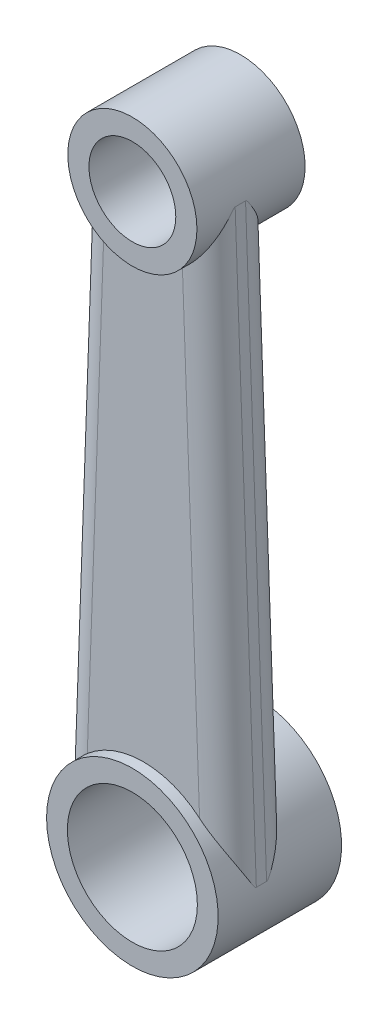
ISO-10303-21;
HEADER;
FILE_DESCRIPTION(('STEP AP214'),'2;1');
FILE_NAME('part.step','',(''),(''),'','','');
FILE_SCHEMA(('AUTOMOTIVE_DESIGN { 1 0 10303 214 1 1 1 1 }'));
ENDSEC;
DATA;
#1=APPLICATION_CONTEXT('core data for automotive mechanical design processes');
#2=APPLICATION_PROTOCOL_DEFINITION('international standard','automotive_design',2000,#1);
#3=PRODUCT_CONTEXT('',#1,'mechanical');
#4=PRODUCT('Part','Part','',(#3));
#5=PRODUCT_RELATED_PRODUCT_CATEGORY('part','',(#4));
#6=PRODUCT_DEFINITION_FORMATION('','',#4);
#7=PRODUCT_DEFINITION_CONTEXT('part definition',#1,'design');
#8=PRODUCT_DEFINITION('design','',#6,#7);
#9=PRODUCT_DEFINITION_SHAPE('','',#8);
#10=(LENGTH_UNIT() NAMED_UNIT(*) SI_UNIT(.MILLI.,.METRE.));
#11=(NAMED_UNIT(*) PLANE_ANGLE_UNIT() SI_UNIT($,.RADIAN.));
#12=(NAMED_UNIT(*) SI_UNIT($,.STERADIAN.) SOLID_ANGLE_UNIT());
#13=UNCERTAINTY_MEASURE_WITH_UNIT(LENGTH_MEASURE(1.E-05),#10,'distance_accuracy_value','');
#14=(GEOMETRIC_REPRESENTATION_CONTEXT(3) GLOBAL_UNCERTAINTY_ASSIGNED_CONTEXT((#13)) GLOBAL_UNIT_ASSIGNED_CONTEXT((#10,
#11,#12)) REPRESENTATION_CONTEXT('',''));
#15=CARTESIAN_POINT('',(0.,0.,0.));
#16=DIRECTION('',(0.,0.,1.));
#17=DIRECTION('',(1.,0.,0.));
#18=AXIS2_PLACEMENT_3D('',#15,#16,#17);
#19=CARTESIAN_POINT('',(0.,57.15,-6.31613333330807));
#20=DIRECTION('',(0.,0.,1.));
#21=DIRECTION('',(1.,0.,0.));
#22=AXIS2_PLACEMENT_3D('',#19,#20,#21);
#23=CYLINDRICAL_SURFACE('',#22,4.24179999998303);
#24=CARTESIAN_POINT('',(0.,57.15,-6.31613333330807));
#25=DIRECTION('',(0.,0.,1.));
#26=DIRECTION('',(1.,0.,0.));
#27=AXIS2_PLACEMENT_3D('',#24,#25,#26);
#28=CIRCLE('',#27,4.24179999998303);
#29=CARTESIAN_POINT('',(4.24179999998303,57.15,-6.31613333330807));
#30=VERTEX_POINT('',#29);
#31=EDGE_CURVE('E172',#30,#30,#28,.T.);
#32=ORIENTED_EDGE('',*,*,#31,.F.);
#33=EDGE_LOOP('',(#32));
#34=FACE_BOUND('',#33,.T.);
#35=CARTESIAN_POINT('',(0.,57.15,4.25026666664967));
#36=DIRECTION('',(0.,0.,1.));
#37=DIRECTION('',(1.,0.,0.));
#38=AXIS2_PLACEMENT_3D('',#35,#36,#37);
#39=CIRCLE('',#38,4.24179999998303);
#40=CARTESIAN_POINT('',(4.24179999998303,57.15,4.25026666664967));
#41=VERTEX_POINT('',#40);
#42=EDGE_CURVE('E20',#41,#41,#39,.F.);
#43=ORIENTED_EDGE('',*,*,#42,.F.);
#44=EDGE_LOOP('',(#43));
#45=FACE_BOUND('',#44,.T.);
#46=ADVANCED_FACE('F17',(#34,#45),#23,.F.);
#47=CARTESIAN_POINT('',(0.,0.,-7.80635133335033));
#48=DIRECTION('',(0.,0.,1.));
#49=DIRECTION('',(1.,0.,0.));
#50=AXIS2_PLACEMENT_3D('',#47,#48,#49);
#51=CYLINDRICAL_SURFACE('',#50,6.3499999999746);
#52=CARTESIAN_POINT('',(0.,0.,-7.80635133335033));
#53=DIRECTION('',(0.,0.,1.));
#54=DIRECTION('',(1.,0.,0.));
#55=AXIS2_PLACEMENT_3D('',#52,#53,#54);
#56=CIRCLE('',#55,6.3499999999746);
#57=CARTESIAN_POINT('',(6.3499999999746,0.,-7.80635133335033));
#58=VERTEX_POINT('',#57);
#59=EDGE_CURVE('E169',#58,#58,#56,.T.);
#60=ORIENTED_EDGE('',*,*,#59,.F.);
#61=EDGE_LOOP('',(#60));
#62=FACE_BOUND('',#61,.T.);
#63=CARTESIAN_POINT('',(0.,0.,4.25026666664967));
#64=DIRECTION('',(0.,0.,1.));
#65=DIRECTION('',(1.,0.,0.));
#66=AXIS2_PLACEMENT_3D('',#63,#64,#65);
#67=CIRCLE('',#66,6.3499999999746);
#68=CARTESIAN_POINT('',(6.3499999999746,0.,4.25026666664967));
#69=VERTEX_POINT('',#68);
#70=EDGE_CURVE('E120',#69,#69,#67,.F.);
#71=ORIENTED_EDGE('',*,*,#70,.F.);
#72=EDGE_LOOP('',(#71));
#73=FACE_BOUND('',#72,.T.);
#74=ADVANCED_FACE('F236',(#62,#73),#51,.F.);
#75=CARTESIAN_POINT('',(-7.34483333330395,28.575,0.0042333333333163));
#76=DIRECTION('',(-0.999341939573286,0.0362724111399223,0.));
#77=DIRECTION('',(-0.0362724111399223,-0.999341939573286,0.));
#78=AXIS2_PLACEMENT_3D('',#75,#76,#77);
#79=PLANE('',#78);
#80=DIRECTION('',(-0.0362724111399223,-0.999341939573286,0.));
#81=VECTOR('',#80,1.);
#82=CARTESIAN_POINT('',(-8.35994380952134,0.607670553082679,-0.499866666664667));
#83=LINE('',#82,#81);
#84=CARTESIAN_POINT('',(-8.35994380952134,0.607670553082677,-0.499866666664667));
#85=VERTEX_POINT('',#84);
#86=CARTESIAN_POINT('',(-6.30766666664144,57.15,-0.499866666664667));
#87=VERTEX_POINT('',#86);
#88=EDGE_CURVE('E99',#85,#87,#83,.F.);
#89=ORIENTED_EDGE('',*,*,#88,.F.);
#90=DIRECTION('',(0.,0.,1.));
#91=VECTOR('',#90,1.);
#92=CARTESIAN_POINT('',(-8.35994380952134,0.607670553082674,0.0042333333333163));
#93=LINE('',#92,#91);
#94=CARTESIAN_POINT('',(-8.35994380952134,0.607670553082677,0.500017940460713));
#95=VERTEX_POINT('',#94);
#96=EDGE_CURVE('E173',#85,#95,#93,.T.);
#97=ORIENTED_EDGE('',*,*,#96,.T.);
#98=DIRECTION('',(-0.0362724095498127,-0.999341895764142,-0.000296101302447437));
#99=VECTOR('',#98,1.);
#100=CARTESIAN_POINT('',(-8.35994380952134,0.607670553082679,0.500017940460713));
#101=LINE('',#100,#99);
#102=CARTESIAN_POINT('',(-6.30766666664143,57.15,0.516771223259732));
#103=VERTEX_POINT('',#102);
#104=EDGE_CURVE('E100',#103,#95,#101,.T.);
#105=ORIENTED_EDGE('',*,*,#104,.F.);
#106=DIRECTION('',(0.,0.,1.));
#107=VECTOR('',#106,1.);
#108=CARTESIAN_POINT('',(-6.30766666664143,57.15,0.0042333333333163));
#109=LINE('',#108,#107);
#110=EDGE_CURVE('E72',#103,#87,#109,.F.);
#111=ORIENTED_EDGE('',*,*,#110,.T.);
#112=EDGE_LOOP('',(#89,#97,#105,#111));
#113=FACE_BOUND('',#112,.T.);
#114=ADVANCED_FACE('F232',(#113),#79,.T.);
#115=CARTESIAN_POINT('',(0.,0.,4.25026666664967));
#116=DIRECTION('',(0.,0.,1.));
#117=DIRECTION('',(1.,0.,0.));
#118=AXIS2_PLACEMENT_3D('',#115,#116,#117);
#119=PLANE('',#118);
#120=ORIENTED_EDGE('',*,*,#42,.T.);
#121=EDGE_LOOP('',(#120));
#122=FACE_BOUND('',#121,.T.);
#123=CARTESIAN_POINT('',(0.,57.15,4.25026666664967));
#124=DIRECTION('',(0.,0.,1.));
#125=DIRECTION('',(1.,0.,0.));
#126=AXIS2_PLACEMENT_3D('',#123,#124,#125);
#127=CIRCLE('',#126,6.30766666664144);
#128=CARTESIAN_POINT('',(6.30766666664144,57.15,4.25026666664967));
#129=VERTEX_POINT('',#128);
#130=EDGE_CURVE('E89',#129,#129,#127,.F.);
#131=ORIENTED_EDGE('',*,*,#130,.F.);
#132=EDGE_LOOP('',(#131));
#133=FACE_BOUND('',#132,.T.);
#134=ADVANCED_FACE('F235',(#122,#133),#119,.T.);
#135=CARTESIAN_POINT('',(0.,0.,-6.31613333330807));
#136=DIRECTION('',(0.,0.,-1.));
#137=DIRECTION('',(-1.,0.,0.));
#138=AXIS2_PLACEMENT_3D('',#135,#136,#137);
#139=PLANE('',#138);
#140=ORIENTED_EDGE('',*,*,#31,.T.);
#141=EDGE_LOOP('',(#140));
#142=FACE_BOUND('',#141,.T.);
#143=CARTESIAN_POINT('',(0.,57.15,-6.31613333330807));
#144=DIRECTION('',(0.,0.,1.));
#145=DIRECTION('',(1.,0.,0.));
#146=AXIS2_PLACEMENT_3D('',#143,#144,#145);
#147=CIRCLE('',#146,6.30766666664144);
#148=CARTESIAN_POINT('',(6.30766666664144,57.15,-6.31613333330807));
#149=VERTEX_POINT('',#148);
#150=EDGE_CURVE('E149',#149,#149,#147,.T.);
#151=ORIENTED_EDGE('',*,*,#150,.F.);
#152=EDGE_LOOP('',(#151));
#153=FACE_BOUND('',#152,.T.);
#154=ADVANCED_FACE('F243',(#142,#153),#139,.T.);
#155=CARTESIAN_POINT('',(7.34483333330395,28.575,0.00423333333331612));
#156=DIRECTION('',(0.999341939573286,0.0362724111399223,0.));
#157=DIRECTION('',(-0.0362724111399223,0.999341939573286,0.));
#158=AXIS2_PLACEMENT_3D('',#155,#156,#157);
#159=PLANE('',#158);
#160=DIRECTION('',(0.0362724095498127,-0.999341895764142,-0.00029610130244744));
#161=VECTOR('',#160,1.);
#162=CARTESIAN_POINT('',(8.35994380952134,0.607670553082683,0.500017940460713));
#163=LINE('',#162,#161);
#164=CARTESIAN_POINT('',(8.35994380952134,0.607670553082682,0.500017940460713));
#165=VERTEX_POINT('',#164);
#166=CARTESIAN_POINT('',(6.30766666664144,57.15,0.516771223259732));
#167=VERTEX_POINT('',#166);
#168=EDGE_CURVE('E167',#165,#167,#163,.F.);
#169=ORIENTED_EDGE('',*,*,#168,.F.);
#170=DIRECTION('',(0.,0.,1.));
#171=VECTOR('',#170,1.);
#172=CARTESIAN_POINT('',(8.35994380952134,0.607670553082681,0.00423333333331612));
#173=LINE('',#172,#171);
#174=CARTESIAN_POINT('',(8.35994380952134,0.607670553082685,-0.499866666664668));
#175=VERTEX_POINT('',#174);
#176=EDGE_CURVE('E170',#165,#175,#173,.F.);
#177=ORIENTED_EDGE('',*,*,#176,.T.);
#178=DIRECTION('',(0.0362724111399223,-0.999341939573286,0.));
#179=VECTOR('',#178,1.);
#180=CARTESIAN_POINT('',(8.35994380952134,0.607670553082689,-0.499866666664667));
#181=LINE('',#180,#179);
#182=CARTESIAN_POINT('',(6.30766666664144,57.15,-0.499866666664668));
#183=VERTEX_POINT('',#182);
#184=EDGE_CURVE('E148',#183,#175,#181,.T.);
#185=ORIENTED_EDGE('',*,*,#184,.F.);
#186=DIRECTION('',(0.,0.,1.));
#187=VECTOR('',#186,1.);
#188=CARTESIAN_POINT('',(6.30766666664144,57.15,0.));
#189=LINE('',#188,#187);
#190=EDGE_CURVE('E156',#167,#183,#189,.F.);
#191=ORIENTED_EDGE('',*,*,#190,.F.);
#192=EDGE_LOOP('',(#169,#177,#185,#191));
#193=FACE_BOUND('',#192,.T.);
#194=ADVANCED_FACE('F221',(#193),#159,.T.);
#195=CARTESIAN_POINT('',(5.6950319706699,0.51094412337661,0.500017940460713));
#196=DIRECTION('',(0.0362724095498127,-0.999341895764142,-0.00029610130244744));
#197=DIRECTION('',(0.999341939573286,0.0362724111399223,0.));
#198=AXIS2_PLACEMENT_3D('',#195,#196,#197);
#199=CYLINDRICAL_SURFACE('',#198,2.666666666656);
#200=CARTESIAN_POINT('',(8.35994380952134,0.607670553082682,0.500017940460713));
#201=CARTESIAN_POINT('',(8.35994534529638,0.607646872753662,0.506234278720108));
#202=CARTESIAN_POINT('',(8.35990044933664,0.608267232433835,0.512414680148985));
#203=CARTESIAN_POINT('',(8.35973329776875,0.61056144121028,0.524457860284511));
#204=CARTESIAN_POINT('',(8.35961254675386,0.612214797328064,0.530324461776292));
#205=CARTESIAN_POINT('',(8.35924016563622,0.617281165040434,0.544294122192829));
#206=CARTESIAN_POINT('',(8.35895416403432,0.621150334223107,0.552225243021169));
#207=CARTESIAN_POINT('',(8.35828884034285,0.630042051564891,0.567478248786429));
#208=CARTESIAN_POINT('',(8.35790861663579,0.635075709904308,0.57479327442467));
#209=CARTESIAN_POINT('',(8.35592628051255,0.660926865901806,0.608913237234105));
#210=CARTESIAN_POINT('',(8.35391417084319,0.686060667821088,0.632223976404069));
#211=CARTESIAN_POINT('',(8.34945523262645,0.738420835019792,0.676225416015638));
#212=CARTESIAN_POINT('',(8.34700430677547,0.765665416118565,0.696887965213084));
#213=CARTESIAN_POINT('',(8.33920249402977,0.847673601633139,0.756104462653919));
#214=CARTESIAN_POINT('',(8.33332376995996,0.903783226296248,0.792823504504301));
#215=CARTESIAN_POINT('',(8.32028703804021,1.01687895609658,0.864644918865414));
#216=CARTESIAN_POINT('',(8.31312702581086,1.07386630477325,0.899744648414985));
#217=CARTESIAN_POINT('',(8.29759169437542,1.18792941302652,0.968796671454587));
#218=CARTESIAN_POINT('',(8.28922381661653,1.24500265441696,1.00275452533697));
#219=CARTESIAN_POINT('',(8.27125677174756,1.35925898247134,1.070064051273));
#220=CARTESIAN_POINT('',(8.26165828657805,1.41644199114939,1.10341604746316));
#221=CARTESIAN_POINT('',(8.23067884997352,1.58990129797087,1.2038732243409));
#222=CARTESIAN_POINT('',(8.20736305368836,1.70624559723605,1.27028208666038));
#223=CARTESIAN_POINT('',(8.15559574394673,1.93865157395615,1.40158326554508));
#224=CARTESIAN_POINT('',(8.12714349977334,2.05471320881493,1.46647536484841));
#225=CARTESIAN_POINT('',(8.03394408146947,2.40234346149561,1.65888106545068));
#226=CARTESIAN_POINT('',(7.96138283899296,2.63319558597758,1.78403086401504));
#227=CARTESIAN_POINT('',(7.79460905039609,3.09222285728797,2.02632527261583));
#228=CARTESIAN_POINT('',(7.70033272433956,3.32038799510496,2.14344495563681));
#229=CARTESIAN_POINT('',(7.48950251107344,3.77190371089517,2.36611901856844));
#230=CARTESIAN_POINT('',(7.37296847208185,3.9952583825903,2.4716835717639));
#231=CARTESIAN_POINT('',(7.16768815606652,4.34807491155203,2.62831970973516));
#232=CARTESIAN_POINT('',(7.08627203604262,4.47961584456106,2.68438930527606));
#233=CARTESIAN_POINT('',(6.9148815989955,4.7398956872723,2.78966934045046));
#234=CARTESIAN_POINT('',(6.82490671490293,4.86863441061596,2.83887932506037));
#235=CARTESIAN_POINT('',(6.63682145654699,5.12203980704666,2.92881177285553));
#236=CARTESIAN_POINT('',(6.53875460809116,5.24672380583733,2.96957597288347));
#237=CARTESIAN_POINT('',(6.33422664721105,5.49190038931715,3.04125858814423));
#238=CARTESIAN_POINT('',(6.22777029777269,5.61239529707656,3.07218254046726));
#239=CARTESIAN_POINT('',(6.01797715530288,5.83634460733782,3.11971281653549));
#240=CARTESIAN_POINT('',(5.91542434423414,5.94028569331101,3.1374554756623));
#241=CARTESIAN_POINT('',(5.70397927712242,6.14363571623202,3.16179292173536));
#242=CARTESIAN_POINT('',(5.59506575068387,6.24302719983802,3.16834779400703));
#243=CARTESIAN_POINT('',(5.48344694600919,6.33953733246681,3.1684117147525));
#244=B_SPLINE_CURVE_WITH_KNOTS('',3,(#200,#201,#202,#203,#204,#205,#206,#207,#208,#209,#210,
#211,#212,#213,#214,#215,#216,#217,#218,#219,#220,#221,#222,#223,#224,#225,#226,#227,#228,#229,
#230,#231,#232,#233,#234,#235,#236,#237,#238,#239,#240,#241,#242,#243),.UNSPECIFIED.,.F.,.F.,(4,
2,2,2,2,2,2,2,2,2,2,2,2,2,2,2,2,2,2,2,2,4),(0.,0.0185603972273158,0.0367637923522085,
0.0631006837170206,0.0897000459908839,0.191654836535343,0.294616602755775,0.496270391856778,
0.698242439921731,0.899019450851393,1.0996856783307,1.50749050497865,1.91535339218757,
2.73164442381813,3.55036428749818,4.36835744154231,4.86166942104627,5.35501410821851,
5.84585938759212,6.33642797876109,6.7771011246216,7.21934319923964),.UNSPECIFIED.);
#245=CARTESIAN_POINT('',(5.48344694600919,6.33953733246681,3.1684117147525));
#246=VERTEX_POINT('',#245);
#247=EDGE_CURVE('E150',#165,#246,#244,.T.);
#248=ORIENTED_EDGE('',*,*,#247,.F.);
#249=ORIENTED_EDGE('',*,*,#168,.T.);
#250=CARTESIAN_POINT('',(3.82136288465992,52.1316492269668,3.18197974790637));
#251=CARTESIAN_POINT('',(3.91233313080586,52.2008918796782,3.18199280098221));
#252=CARTESIAN_POINT('',(4.00131565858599,52.2725845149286,3.17711515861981));
#253=CARTESIAN_POINT('',(4.17460117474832,52.4200735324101,3.15870059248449));
#254=CARTESIAN_POINT('',(4.25891271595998,52.4958618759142,3.14518010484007));
#255=CARTESIAN_POINT('',(4.42161587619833,52.6501739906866,3.11078078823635));
#256=CARTESIAN_POINT('',(4.50006169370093,52.7286592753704,3.08998318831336));
#257=CARTESIAN_POINT('',(4.65182999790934,52.8886272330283,3.04195729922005));
#258=CARTESIAN_POINT('',(4.7251492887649,52.9701117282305,3.01472504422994));
#259=CARTESIAN_POINT('',(4.89190860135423,53.1653086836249,2.94391434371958));
#260=CARTESIAN_POINT('',(4.98311189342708,53.2800806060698,2.89797838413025));
#261=CARTESIAN_POINT('',(5.15573221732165,53.5132240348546,2.7977105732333));
#262=CARTESIAN_POINT('',(5.23714724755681,53.6315962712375,2.7433770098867));
#263=CARTESIAN_POINT('',(5.39083734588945,53.8718914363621,2.62749513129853));
#264=CARTESIAN_POINT('',(5.46305296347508,53.99383175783,2.56590439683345));
#265=CARTESIAN_POINT('',(5.59801070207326,54.2399086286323,2.43706855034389));
#266=CARTESIAN_POINT('',(5.66075268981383,54.3640452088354,2.36982335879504));
#267=CARTESIAN_POINT('',(5.80073851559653,54.6649015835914,2.20241596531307));
#268=CARTESIAN_POINT('',(5.87349389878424,54.842462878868,2.09999418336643));
#269=CARTESIAN_POINT('',(6.0016298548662,55.1998298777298,1.88833817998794));
#270=CARTESIAN_POINT('',(6.05700107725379,55.3796367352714,1.77910033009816));
#271=CARTESIAN_POINT('',(6.15084786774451,55.7399450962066,1.55591172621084));
#272=CARTESIAN_POINT('',(6.18937390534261,55.9204428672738,1.44197618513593));
#273=CARTESIAN_POINT('',(6.23503025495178,56.1911334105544,1.26802389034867));
#274=CARTESIAN_POINT('',(6.24822553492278,56.2813367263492,1.20954328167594));
#275=CARTESIAN_POINT('',(6.27063160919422,56.4614699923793,1.09141643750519));
#276=CARTESIAN_POINT('',(6.27984265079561,56.5513999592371,1.03177027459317));
#277=CARTESIAN_POINT('',(6.29309522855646,56.7151050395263,0.920984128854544));
#278=CARTESIAN_POINT('',(6.29775061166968,56.7890187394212,0.870129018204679));
#279=CARTESIAN_POINT('',(6.30314441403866,56.9069556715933,0.785072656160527));
#280=CARTESIAN_POINT('',(6.30469892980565,56.9516719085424,0.751879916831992));
#281=CARTESIAN_POINT('',(6.30643117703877,57.0222771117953,0.694921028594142));
#282=CARTESIAN_POINT('',(6.30690608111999,57.0489733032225,0.672250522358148));
#283=CARTESIAN_POINT('',(6.30736072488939,57.0865602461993,0.635288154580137));
#284=CARTESIAN_POINT('',(6.30746910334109,57.098774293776,0.622349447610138));
#285=CARTESIAN_POINT('',(6.30760973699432,57.1210938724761,0.594761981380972));
#286=CARTESIAN_POINT('',(6.30764284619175,57.1312218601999,0.580134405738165));
#287=CARTESIAN_POINT('',(6.30766136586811,57.1413306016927,0.558451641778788));
#288=CARTESIAN_POINT('',(6.30766374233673,57.1436569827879,0.552542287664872));
#289=CARTESIAN_POINT('',(6.30766635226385,57.1473020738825,0.540431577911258));
#290=CARTESIAN_POINT('',(6.30766659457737,57.1486249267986,0.534231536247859));
#291=CARTESIAN_POINT('',(6.30766665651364,57.1497847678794,0.524251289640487));
#292=CARTESIAN_POINT('',(6.3076666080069,57.150007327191,0.520512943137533));
#293=CARTESIAN_POINT('',(6.30766666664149,57.1499999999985,0.516771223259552));
#294=B_SPLINE_CURVE_WITH_KNOTS('',3,(#250,#251,#252,#253,#254,#255,#256,#257,#258,#259,#260,
#261,#262,#263,#264,#265,#266,#267,#268,#269,#270,#271,#272,#273,#274,#275,#276,#277,#278,#279,
#280,#281,#282,#283,#284,#285,#286,#287,#288,#289,#290,#291,#292,#293),.UNSPECIFIED.,.F.,.F.,(4,
2,2,2,2,2,2,2,2,2,2,2,2,2,2,2,2,2,2,2,2,4),(0.,0.34268462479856,0.684719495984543,
1.02305225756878,1.36159408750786,1.82178278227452,2.28206542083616,2.74518607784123,
3.20831324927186,3.85990228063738,4.51184118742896,5.16181322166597,5.48667308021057,
5.8115127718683,6.08093308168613,6.24805333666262,6.35290658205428,6.40626449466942,
6.45901392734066,6.47800037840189,6.49690801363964,6.50812239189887),.UNSPECIFIED.);
#295=CARTESIAN_POINT('',(3.82136288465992,52.1316492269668,3.18197974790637));
#296=VERTEX_POINT('',#295);
#297=EDGE_CURVE('E88',#296,#167,#294,.T.);
#298=ORIENTED_EDGE('',*,*,#297,.F.);
#299=DIRECTION('',(-0.0362724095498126,0.999341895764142,0.000296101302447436));
#300=VECTOR('',#299,1.);
#301=CARTESIAN_POINT('',(5.48344694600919,6.33953733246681,3.1684117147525));
#302=LINE('',#301,#300);
#303=EDGE_CURVE('E85',#246,#296,#302,.T.);
#304=ORIENTED_EDGE('',*,*,#303,.F.);
#305=EDGE_LOOP('',(#248,#249,#298,#304));
#306=FACE_BOUND('',#305,.T.);
#307=ADVANCED_FACE('F218',(#306),#199,.T.);
#308=CARTESIAN_POINT('',(0.,0.,-7.80635133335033));
#309=DIRECTION('',(0.,0.,-1.));
#310=DIRECTION('',(-1.,0.,0.));
#311=AXIS2_PLACEMENT_3D('',#308,#309,#310);
#312=PLANE('',#311);
#313=ORIENTED_EDGE('',*,*,#59,.T.);
#314=EDGE_LOOP('',(#313));
#315=FACE_BOUND('',#314,.T.);
#316=CARTESIAN_POINT('',(0.,0.,-7.80635133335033));
#317=DIRECTION('',(0.,0.,-1.));
#318=DIRECTION('',(-1.,0.,0.));
#319=AXIS2_PLACEMENT_3D('',#316,#317,#318);
#320=CIRCLE('',#319,8.38199999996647);
#321=CARTESIAN_POINT('',(-8.38199999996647,0.,-7.80635133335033));
#322=VERTEX_POINT('',#321);
#323=EDGE_CURVE('E205',#322,#322,#320,.F.);
#324=ORIENTED_EDGE('',*,*,#323,.F.);
#325=EDGE_LOOP('',(#324));
#326=FACE_BOUND('',#325,.T.);
#327=ADVANCED_FACE('F295',(#315,#326),#312,.T.);
#328=CARTESIAN_POINT('',(0.,0.,4.25026666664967));
#329=DIRECTION('',(0.,0.,1.));
#330=DIRECTION('',(1.,0.,0.));
#331=AXIS2_PLACEMENT_3D('',#328,#329,#330);
#332=PLANE('',#331);
#333=ORIENTED_EDGE('',*,*,#70,.T.);
#334=EDGE_LOOP('',(#333));
#335=FACE_BOUND('',#334,.T.);
#336=CARTESIAN_POINT('',(0.,0.,4.25026666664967));
#337=DIRECTION('',(0.,0.,-1.));
#338=DIRECTION('',(-1.,0.,0.));
#339=AXIS2_PLACEMENT_3D('',#336,#337,#338);
#340=CIRCLE('',#339,8.38199999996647);
#341=CARTESIAN_POINT('',(-8.38199999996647,0.,4.25026666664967));
#342=VERTEX_POINT('',#341);
#343=EDGE_CURVE('E207',#342,#342,#340,.T.);
#344=ORIENTED_EDGE('',*,*,#343,.F.);
#345=EDGE_LOOP('',(#344));
#346=FACE_BOUND('',#345,.T.);
#347=ADVANCED_FACE('F288',(#335,#346),#332,.T.);
#348=CARTESIAN_POINT('',(0.,28.575,3.1749999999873));
#349=DIRECTION('',(0.,-0.000296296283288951,0.999999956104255));
#350=DIRECTION('',(0.,-0.999999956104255,-0.000296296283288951));
#351=AXIS2_PLACEMENT_3D('',#348,#349,#350);
#352=PLANE('',#351);
#353=DIRECTION('',(-0.0362724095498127,-0.999341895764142,-0.000296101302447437));
#354=VECTOR('',#353,1.);
#355=CARTESIAN_POINT('',(-5.6950319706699,0.510153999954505,3.16668449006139));
#356=LINE('',#355,#354);
#357=CARTESIAN_POINT('',(-5.48344694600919,6.33953733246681,3.1684117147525));
#358=VERTEX_POINT('',#357);
#359=CARTESIAN_POINT('',(-3.82136288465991,52.1316492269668,3.18197974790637));
#360=VERTEX_POINT('',#359);
#361=EDGE_CURVE('E82',#358,#360,#356,.F.);
#362=ORIENTED_EDGE('',*,*,#361,.F.);
#363=CARTESIAN_POINT('',(0.,0.,3.16653333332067));
#364=DIRECTION('',(0.,-0.000296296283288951,0.999999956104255));
#365=DIRECTION('',(0.,-0.999999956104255,-0.000296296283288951));
#366=AXIS2_PLACEMENT_3D('',#363,#364,#365);
#367=ELLIPSE('',#366,8.38200036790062,8.38199999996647);
#368=EDGE_CURVE('E184',#246,#358,#367,.T.);
#369=ORIENTED_EDGE('',*,*,#368,.F.);
#370=ORIENTED_EDGE('',*,*,#303,.T.);
#371=CARTESIAN_POINT('',(0.,57.15,3.18346666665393));
#372=DIRECTION('',(0.,-0.000296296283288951,0.999999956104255));
#373=DIRECTION('',(0.,0.999999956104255,0.000296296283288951));
#374=AXIS2_PLACEMENT_3D('',#371,#372,#373);
#375=ELLIPSE('',#374,6.30766694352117,6.30766666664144);
#376=EDGE_CURVE('E78',#360,#296,#375,.T.);
#377=ORIENTED_EDGE('',*,*,#376,.F.);
#378=EDGE_LOOP('',(#362,#369,#370,#377));
#379=FACE_BOUND('',#378,.T.);
#380=ADVANCED_FACE('F80',(#379),#352,.T.);
#381=CARTESIAN_POINT('',(-5.6950319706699,0.510944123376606,0.500017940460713));
#382=DIRECTION('',(-0.0362724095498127,-0.999341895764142,-0.000296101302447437));
#383=DIRECTION('',(0.999341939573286,-0.0362724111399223,0.));
#384=AXIS2_PLACEMENT_3D('',#381,#382,#383);
#385=CYLINDRICAL_SURFACE('',#384,2.666666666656);
#386=CARTESIAN_POINT('',(-5.48344694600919,6.33953733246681,3.1684117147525));
#387=CARTESIAN_POINT('',(-5.59060742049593,6.24687954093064,3.16835477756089));
#388=CARTESIAN_POINT('',(-5.69528692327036,6.15155732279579,3.1623082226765));
#389=CARTESIAN_POINT('',(-5.8989417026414,5.95652093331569,3.1397817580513));
#390=CARTESIAN_POINT('',(-5.99792735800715,5.8568153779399,3.12332153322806));
#391=CARTESIAN_POINT('',(-6.18915170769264,5.65434443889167,3.08165625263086));
#392=CARTESIAN_POINT('',(-6.28143481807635,5.55160707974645,3.05651665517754));
#393=CARTESIAN_POINT('',(-6.45988642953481,5.3429066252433,2.99870973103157));
#394=CARTESIAN_POINT('',(-6.54605105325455,5.23694154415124,2.96603768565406));
#395=CARTESIAN_POINT('',(-6.75115662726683,4.97187942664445,2.87740430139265));
#396=CARTESIAN_POINT('',(-6.86647224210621,4.81121462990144,2.81771370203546));
#397=CARTESIAN_POINT('',(-7.08364798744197,4.48533535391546,2.68733651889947));
#398=CARTESIAN_POINT('',(-7.18550337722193,4.32011929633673,2.61664607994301));
#399=CARTESIAN_POINT('',(-7.37631885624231,3.98560340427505,2.46631491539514));
#400=CARTESIAN_POINT('',(-7.4652379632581,3.81629249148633,2.38664710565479));
#401=CARTESIAN_POINT('',(-7.6301315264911,3.47490192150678,2.22039795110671));
#402=CARTESIAN_POINT('',(-7.70611028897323,3.30282320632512,2.13381892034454));
#403=CARTESIAN_POINT('',(-7.83533125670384,2.98176392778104,1.96823344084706));
#404=CARTESIAN_POINT('',(-7.89027345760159,2.83308013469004,1.88996761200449));
#405=CARTESIAN_POINT('',(-7.99111597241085,2.5347095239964,1.73028883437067));
#406=CARTESIAN_POINT('',(-8.03703141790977,2.38502482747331,1.64888143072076));
#407=CARTESIAN_POINT('',(-8.13500178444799,2.03087186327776,1.45367260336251));
#408=CARTESIAN_POINT('',(-8.18335691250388,1.82600079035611,1.33872023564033));
#409=CARTESIAN_POINT('',(-8.25012188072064,1.48727049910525,1.14482387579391));
#410=CARTESIAN_POINT('',(-8.27309746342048,1.35349474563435,1.06726086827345));
#411=CARTESIAN_POINT('',(-8.3051812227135,1.13543837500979,0.937394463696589));
#412=CARTESIAN_POINT('',(-8.31629490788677,1.05083356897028,0.886152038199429));
#413=CARTESIAN_POINT('',(-8.33215800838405,0.914278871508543,0.799528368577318));
#414=CARTESIAN_POINT('',(-8.33774618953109,0.86174045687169,0.765228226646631));
#415=CARTESIAN_POINT('',(-8.34591682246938,0.777603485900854,0.70591296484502));
#416=CARTESIAN_POINT('',(-8.34885561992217,0.745300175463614,0.682022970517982));
#417=CARTESIAN_POINT('',(-8.35281277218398,0.69906466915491,0.643152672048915));
#418=CARTESIAN_POINT('',(-8.35406217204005,0.683946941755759,0.62960818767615));
#419=CARTESIAN_POINT('',(-8.3563458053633,0.655441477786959,0.600747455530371));
#420=CARTESIAN_POINT('',(-8.35738131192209,0.642043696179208,0.585442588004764));
#421=CARTESIAN_POINT('',(-8.35851144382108,0.62707844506,0.562581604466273));
#422=CARTESIAN_POINT('',(-8.35878132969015,0.623465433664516,0.556419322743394));
#423=CARTESIAN_POINT('',(-8.35924985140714,0.617151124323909,0.543668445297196));
#424=CARTESIAN_POINT('',(-8.35944889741,0.61444458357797,0.53708257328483));
#425=CARTESIAN_POINT('',(-8.35971107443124,0.610865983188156,0.525429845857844));
#426=CARTESIAN_POINT('',(-8.35979670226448,0.609691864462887,0.520458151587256));
#427=CARTESIAN_POINT('',(-8.35991382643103,0.608083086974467,0.510336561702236));
#428=CARTESIAN_POINT('',(-8.35994465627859,0.607657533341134,0.505185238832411));
#429=CARTESIAN_POINT('',(-8.35994380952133,0.607670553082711,0.500017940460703));
#430=B_SPLINE_CURVE_WITH_KNOTS('',3,(#386,#387,#388,#389,#390,#391,#392,#393,#394,#395,#396,
#397,#398,#399,#400,#401,#402,#403,#404,#405,#406,#407,#408,#409,#410,#411,#412,#413,#414,#415,
#416,#417,#418,#419,#420,#421,#422,#423,#424,#425,#426,#427,#428,#429),.UNSPECIFIED.,.F.,.F.,(4,
2,2,2,2,2,2,2,2,2,2,2,2,2,2,2,2,2,2,2,2,4),(0.,0.424630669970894,0.848461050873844,
1.26916238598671,1.69012798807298,2.30891636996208,2.92792211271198,3.54884805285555,
4.16956695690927,4.69963643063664,5.22880962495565,5.94768426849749,6.41654244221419,
6.71505708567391,6.90401184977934,7.02466870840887,7.08566210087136,7.14628127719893,
7.16767722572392,7.18894719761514,7.204221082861,7.2196794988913),.UNSPECIFIED.);
#431=EDGE_CURVE('E97',#358,#95,#430,.T.);
#432=ORIENTED_EDGE('',*,*,#431,.F.);
#433=ORIENTED_EDGE('',*,*,#361,.T.);
#434=CARTESIAN_POINT('',(-6.30766666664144,57.15,0.516771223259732));
#435=CARTESIAN_POINT('',(-6.30766641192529,57.150026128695,0.523128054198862));
#436=CARTESIAN_POINT('',(-6.30766668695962,57.1493742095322,0.529443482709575));
#437=CARTESIAN_POINT('',(-6.30766611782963,57.1469785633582,0.541738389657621));
#438=CARTESIAN_POINT('',(-6.30766529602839,57.145257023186,0.54772206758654));
#439=CARTESIAN_POINT('',(-6.30765935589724,57.1399263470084,0.562193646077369));
#440=CARTESIAN_POINT('',(-6.30765234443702,57.1358065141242,0.570486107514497));
#441=CARTESIAN_POINT('',(-6.30762433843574,57.1263865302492,0.586453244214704));
#442=CARTESIAN_POINT('',(-6.30760319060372,57.1210738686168,0.594120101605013));
#443=CARTESIAN_POINT('',(-6.30746244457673,57.0956614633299,0.627616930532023));
#444=CARTESIAN_POINT('',(-6.30722902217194,57.0719964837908,0.650597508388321));
#445=CARTESIAN_POINT('',(-6.30643689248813,57.0228994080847,0.694407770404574));
#446=CARTESIAN_POINT('',(-6.30587649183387,56.9974587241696,0.715225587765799));
#447=CARTESIAN_POINT('',(-6.30369847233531,56.9206412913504,0.775554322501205));
#448=CARTESIAN_POINT('',(-6.30158266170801,56.8680659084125,0.813589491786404));
#449=CARTESIAN_POINT('',(-6.29595518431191,56.762101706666,0.888398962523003));
#450=CARTESIAN_POINT('',(-6.2924418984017,56.7087120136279,0.92517174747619));
#451=CARTESIAN_POINT('',(-6.28401659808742,56.6016785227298,0.997848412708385));
#452=CARTESIAN_POINT('',(-6.27910902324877,56.5480360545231,1.03375466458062));
#453=CARTESIAN_POINT('',(-6.26788065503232,56.4405962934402,1.10505425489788));
#454=CARTESIAN_POINT('',(-6.26156035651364,56.3867990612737,1.14044776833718));
#455=CARTESIAN_POINT('',(-6.2297538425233,56.1433358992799,1.29963461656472));
#456=CARTESIAN_POINT('',(-6.19613350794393,55.9532086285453,1.42123707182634));
#457=CARTESIAN_POINT('',(-6.1106552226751,55.5737810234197,1.65957275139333));
#458=CARTESIAN_POINT('',(-6.05878130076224,55.384481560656,1.77630161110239));
#459=CARTESIAN_POINT('',(-5.93599322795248,55.0075753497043,2.00317160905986));
#460=CARTESIAN_POINT('',(-5.86504564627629,54.8199721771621,2.1133007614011));
#461=CARTESIAN_POINT('',(-5.70333220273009,54.4482022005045,2.32421722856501));
#462=CARTESIAN_POINT('',(-5.61258429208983,54.2640324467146,2.42501288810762));
#463=CARTESIAN_POINT('',(-5.45365613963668,53.9785004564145,2.57350871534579));
#464=CARTESIAN_POINT('',(-5.39245056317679,53.875447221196,2.62546354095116));
#465=CARTESIAN_POINT('',(-5.26311011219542,53.6713563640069,2.72445775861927));
#466=CARTESIAN_POINT('',(-5.19497387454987,53.5703191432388,2.77149618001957));
#467=CARTESIAN_POINT('',(-4.9805892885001,53.2718563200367,2.90347094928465));
#468=CARTESIAN_POINT('',(-4.82369500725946,53.0778588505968,2.97991659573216));
#469=CARTESIAN_POINT('',(-4.59100398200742,52.8235864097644,3.06207439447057));
#470=CARTESIAN_POINT('',(-4.52705657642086,52.7567010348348,3.08185908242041));
#471=CARTESIAN_POINT('',(-4.3956226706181,52.6252033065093,3.11658133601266));
#472=CARTESIAN_POINT('',(-4.32813769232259,52.5605899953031,3.13152096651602));
#473=CARTESIAN_POINT('',(-4.18926817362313,52.4334746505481,3.15606460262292));
#474=CARTESIAN_POINT('',(-4.11785737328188,52.3709929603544,3.16562618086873));
#475=CARTESIAN_POINT('',(-3.97187658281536,52.2489843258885,3.17859463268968));
#476=CARTESIAN_POINT('',(-3.89730283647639,52.1894610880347,3.1819939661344));
#477=CARTESIAN_POINT('',(-3.82136288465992,52.1316492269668,3.18197974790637));
#478=B_SPLINE_CURVE_WITH_KNOTS('',3,(#434,#435,#436,#437,#438,#439,#440,#441,#442,#443,#444,
#445,#446,#447,#448,#449,#450,#451,#452,#453,#454,#455,#456,#457,#458,#459,#460,#461,#462,#463,
#464,#465,#466,#467,#468,#469,#470,#471,#472,#473,#474,#475,#476,#477),.UNSPECIFIED.,.F.,.F.,(4,
2,2,2,2,2,2,2,2,2,2,2,2,2,2,2,2,2,2,2,2,4),(0.,0.0189710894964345,0.0375612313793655,
0.0651815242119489,0.0931062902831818,0.191309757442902,0.290026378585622,0.484591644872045,
0.679382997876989,0.873560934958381,1.06767096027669,1.75135953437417,2.43564780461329,
3.12114334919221,3.80601997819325,4.19764440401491,4.58934600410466,5.36817383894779,
5.65190219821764,5.93550947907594,6.22132383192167,6.5074876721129),.UNSPECIFIED.);
#479=EDGE_CURVE('E95',#103,#360,#478,.T.);
#480=ORIENTED_EDGE('',*,*,#479,.F.);
#481=ORIENTED_EDGE('',*,*,#104,.T.);
#482=EDGE_LOOP('',(#432,#433,#480,#481));
#483=FACE_BOUND('',#482,.T.);
#484=ADVANCED_FACE('F93',(#483),#385,.T.);
#485=CARTESIAN_POINT('',(-5.6950319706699,0.510944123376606,-0.499866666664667));
#486=DIRECTION('',(-0.0362724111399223,-0.999341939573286,0.));
#487=DIRECTION('',(0.999341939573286,-0.0362724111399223,0.));
#488=AXIS2_PLACEMENT_3D('',#485,#486,#487);
#489=CYLINDRICAL_SURFACE('',#488,2.666666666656);
#490=CARTESIAN_POINT('',(-8.35994380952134,0.607670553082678,-0.499866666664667));
#491=CARTESIAN_POINT('',(-8.35994534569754,0.607646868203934,-0.50608141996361));
#492=CARTESIAN_POINT('',(-8.35990047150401,0.608266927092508,-0.512260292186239));
#493=CARTESIAN_POINT('',(-8.35973338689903,0.610560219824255,-0.524300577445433));
#494=CARTESIAN_POINT('',(-8.35961268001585,0.61221297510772,-0.530165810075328));
#495=CARTESIAN_POINT('',(-8.35924046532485,0.617277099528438,-0.544130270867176));
#496=CARTESIAN_POINT('',(-8.35895461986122,0.621144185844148,-0.552057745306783));
#497=CARTESIAN_POINT('',(-8.35828964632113,0.630031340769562,-0.567303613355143));
#498=CARTESIAN_POINT('',(-8.35790961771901,0.635062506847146,-0.574615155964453));
#499=CARTESIAN_POINT('',(-8.35592941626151,0.660886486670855,-0.608698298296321));
#500=CARTESIAN_POINT('',(-8.35391998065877,0.685988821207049,-0.631981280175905));
#501=CARTESIAN_POINT('',(-8.34946708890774,0.738285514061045,-0.675928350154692));
#502=CARTESIAN_POINT('',(-8.34701954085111,0.765498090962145,-0.696564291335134));
#503=CARTESIAN_POINT('',(-8.3392287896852,0.847410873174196,-0.755702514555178));
#504=CARTESIAN_POINT('',(-8.33335877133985,0.90345643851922,-0.792370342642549));
#505=CARTESIAN_POINT('',(-8.32034213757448,1.01642433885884,-0.864089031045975));
#506=CARTESIAN_POINT('',(-8.3131935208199,1.07334791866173,-0.899137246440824));
#507=CARTESIAN_POINT('',(-8.29768363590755,1.18728392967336,-0.968086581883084));
#508=CARTESIAN_POINT('',(-8.28932979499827,1.2442938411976,-1.00199326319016));
#509=CARTESIAN_POINT('',(-8.27139352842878,1.35842377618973,-1.06920067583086));
#510=CARTESIAN_POINT('',(-8.26181178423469,1.41554372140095,-1.10250173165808));
#511=CARTESIAN_POINT('',(-8.23088836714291,1.5888059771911,-1.20280145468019));
#512=CARTESIAN_POINT('',(-8.20761640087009,1.7050166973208,-1.26910453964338));
#513=CARTESIAN_POINT('',(-8.15594883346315,1.9371569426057,-1.40019729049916));
#514=CARTESIAN_POINT('',(-8.12755250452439,2.05308642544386,-1.46498673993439));
#515=CARTESIAN_POINT('',(-8.0345396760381,2.40032214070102,-1.65709057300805));
#516=CARTESIAN_POINT('',(-7.96212784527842,2.63091429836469,-1.78204756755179));
#517=CARTESIAN_POINT('',(-7.79570607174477,3.08943245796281,-2.02398507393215));
#518=CARTESIAN_POINT('',(-7.7016323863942,3.31734846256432,-2.14094069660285));
#519=CARTESIAN_POINT('',(-7.49126464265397,3.76838198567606,-2.36333069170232));
#520=CARTESIAN_POINT('',(-7.37499028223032,3.99150356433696,-2.4687751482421));
#521=CARTESIAN_POINT('',(-7.17004364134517,4.34419162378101,-2.62537184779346));
#522=CARTESIAN_POINT('',(-7.08866803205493,4.47582538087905,-2.6814914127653));
#523=CARTESIAN_POINT('',(-6.9173520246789,4.73629154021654,-2.78687652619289));
#524=CARTESIAN_POINT('',(-6.82741106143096,4.86512375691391,-2.83614162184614));
#525=CARTESIAN_POINT('',(-6.63938595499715,5.11871692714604,-2.92618992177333));
#526=CARTESIAN_POINT('',(-6.54134535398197,5.24349519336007,-2.96701481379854));
#527=CARTESIAN_POINT('',(-6.33686166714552,5.48886148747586,-3.03882518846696));
#528=CARTESIAN_POINT('',(-6.23042332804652,5.6094518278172,-3.06981618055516));
#529=CARTESIAN_POINT('',(-6.02026186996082,5.83400349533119,-3.11756979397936));
#530=CARTESIAN_POINT('',(-5.91729776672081,5.93843520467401,-3.13543044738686));
#531=CARTESIAN_POINT('',(-5.70497211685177,6.14272947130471,-3.15991449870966));
#532=CARTESIAN_POINT('',(-5.59558896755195,6.24257431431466,-3.1664973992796));
#533=CARTESIAN_POINT('',(-5.48347655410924,6.3395117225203,-3.16653333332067));
#534=B_SPLINE_CURVE_WITH_KNOTS('',3,(#490,#491,#492,#493,#494,#495,#496,#497,#498,#499,#500,
#501,#502,#503,#504,#505,#506,#507,#508,#509,#510,#511,#512,#513,#514,#515,#516,#517,#518,#519,
#520,#521,#522,#523,#524,#525,#526,#527,#528,#529,#530,#531,#532,#533),.UNSPECIFIED.,.F.,.F.,(4,
2,2,2,2,2,2,2,2,2,2,2,2,2,2,2,2,2,2,2,2,4),(0.,0.0185557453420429,0.0367547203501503,
0.0630790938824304,0.0896655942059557,0.191495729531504,0.29433192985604,0.495739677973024,
0.697465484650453,0.897997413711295,1.0984185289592,1.50570336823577,1.91304609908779,
2.72829500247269,3.5459742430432,4.36293132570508,4.85645684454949,5.3500149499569,
5.84107375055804,6.3318569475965,6.77446574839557,7.21866060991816),.UNSPECIFIED.);
#535=CARTESIAN_POINT('',(-5.48347655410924,6.33951172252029,-3.16653333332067));
#536=VERTEX_POINT('',#535);
#537=EDGE_CURVE('E199',#85,#536,#534,.T.);
#538=ORIENTED_EDGE('',*,*,#537,.F.);
#539=ORIENTED_EDGE('',*,*,#88,.T.);
#540=CARTESIAN_POINT('',(-3.82139079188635,52.1316704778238,-3.16653333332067));
#541=CARTESIAN_POINT('',(-3.91236105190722,52.2009139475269,-3.16652584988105));
#542=CARTESIAN_POINT('',(-4.00134282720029,52.2726068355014,-3.1616269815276));
#543=CARTESIAN_POINT('',(-4.1746255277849,52.4200950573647,-3.14316913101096));
#544=CARTESIAN_POINT('',(-4.25893501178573,52.4958823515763,-3.12962659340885));
#545=CARTESIAN_POINT('',(-4.42163289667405,52.650190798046,-3.09518309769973));
#546=CARTESIAN_POINT('',(-4.50007552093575,52.7286734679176,-3.07436339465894));
#547=CARTESIAN_POINT('',(-4.65183688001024,52.8886348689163,-3.02629326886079));
#548=CARTESIAN_POINT('',(-4.72515241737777,52.9701154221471,-2.99903887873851));
#549=CARTESIAN_POINT('',(-4.891910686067,53.1653110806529,-2.92817272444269));
#550=CARTESIAN_POINT('',(-4.98311574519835,53.2800854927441,-2.88220265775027));
#551=CARTESIAN_POINT('',(-5.15573809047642,53.5132322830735,-2.78186601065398));
#552=CARTESIAN_POINT('',(-5.23715337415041,53.6316053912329,-2.72749771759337));
#553=CARTESIAN_POINT('',(-5.39084320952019,53.871901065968,-2.61154585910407));
#554=CARTESIAN_POINT('',(-5.46305828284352,53.9938410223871,-2.54991985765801));
#555=CARTESIAN_POINT('',(-5.59801439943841,54.2399158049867,-2.42101354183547));
#556=CARTESIAN_POINT('',(-5.66075530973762,54.364050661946,-2.35373314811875));
#557=CARTESIAN_POINT('',(-5.80074973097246,54.6649259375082,-2.18622764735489));
#558=CARTESIAN_POINT('',(-5.87351218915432,54.8425077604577,-2.08374178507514));
#559=CARTESIAN_POINT('',(-6.00165800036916,55.1999145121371,-1.87195652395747));
#560=CARTESIAN_POINT('',(-6.05703199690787,55.3797405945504,-1.76265349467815));
#561=CARTESIAN_POINT('',(-6.15088070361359,55.7400859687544,-1.53933439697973));
#562=CARTESIAN_POINT('',(-6.18940590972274,55.9206015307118,-1.42533354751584));
#563=CARTESIAN_POINT('',(-6.23505871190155,56.191317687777,-1.25128308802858));
#564=CARTESIAN_POINT('',(-6.24825242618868,56.2815293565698,-1.1927697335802));
#565=CARTESIAN_POINT('',(-6.27065464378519,56.4616787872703,-1.07457718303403));
#566=CARTESIAN_POINT('',(-6.27986339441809,56.5516165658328,-1.01489805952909));
#567=CARTESIAN_POINT('',(-6.29310923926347,56.7153109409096,-0.904066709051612));
#568=CARTESIAN_POINT('',(-6.29776115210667,56.7892065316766,-0.853199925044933));
#569=CARTESIAN_POINT('',(-6.30315021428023,56.9071090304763,-0.768126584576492));
#570=CARTESIAN_POINT('',(-6.30470314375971,56.9518095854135,-0.73492888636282));
#571=CARTESIAN_POINT('',(-6.30643332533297,57.0223858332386,-0.677962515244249));
#572=CARTESIAN_POINT('',(-6.30690756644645,57.0490694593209,-0.655289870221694));
#573=CARTESIAN_POINT('',(-6.3073614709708,57.0866358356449,-0.618323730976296));
#574=CARTESIAN_POINT('',(-6.30746964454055,57.0988428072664,-0.605383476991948));
#575=CARTESIAN_POINT('',(-6.3076099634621,57.1211463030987,-0.577792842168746));
#576=CARTESIAN_POINT('',(-6.30764296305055,57.1312653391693,-0.563163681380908));
#577=CARTESIAN_POINT('',(-6.30766140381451,57.1413594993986,-0.541480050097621));
#578=CARTESIAN_POINT('',(-6.30766376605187,57.1436818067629,-0.535570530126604));
#579=CARTESIAN_POINT('',(-6.30766635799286,57.1473184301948,-0.523460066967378));
#580=CARTESIAN_POINT('',(-6.3076665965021,57.1486368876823,-0.517260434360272));
#581=CARTESIAN_POINT('',(-6.30766665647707,57.1497873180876,-0.507302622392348));
#582=CARTESIAN_POINT('',(-6.30766660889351,57.1500072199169,-0.503586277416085));
#583=CARTESIAN_POINT('',(-6.30766666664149,57.1499999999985,-0.499866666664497));
#584=B_SPLINE_CURVE_WITH_KNOTS('',3,(#540,#541,#542,#543,#544,#545,#546,#547,#548,#549,#550,
#551,#552,#553,#554,#555,#556,#557,#558,#559,#560,#561,#562,#563,#564,#565,#566,#567,#568,#569,
#570,#571,#572,#573,#574,#575,#576,#577,#578,#579,#580,#581,#582,#583),.UNSPECIFIED.,.F.,.F.,(4,
2,2,2,2,2,2,2,2,2,2,2,2,2,2,2,2,2,2,2,2,4),(0.,0.342686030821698,0.684722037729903,
1.02305491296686,1.36159693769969,1.82182487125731,2.28214678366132,2.74530800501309,
3.20847572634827,3.8602123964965,4.51229915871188,5.16241799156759,5.48735118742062,
5.81226421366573,6.08165910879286,6.24875034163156,6.35357878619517,6.40692544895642,
6.45966281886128,6.47864520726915,6.49754885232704,6.50869719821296),.UNSPECIFIED.);
#585=CARTESIAN_POINT('',(-3.82139079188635,52.1316704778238,-3.16653333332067));
#586=VERTEX_POINT('',#585);
#587=EDGE_CURVE('E104',#586,#87,#584,.T.);
#588=ORIENTED_EDGE('',*,*,#587,.F.);
#589=DIRECTION('',(0.0362724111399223,0.999341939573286,0.));
#590=VECTOR('',#589,1.);
#591=CARTESIAN_POINT('',(-5.48347655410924,6.33951172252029,-3.16653333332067));
#592=LINE('',#591,#590);
#593=EDGE_CURVE('E179',#536,#586,#592,.T.);
#594=ORIENTED_EDGE('',*,*,#593,.F.);
#595=EDGE_LOOP('',(#538,#539,#588,#594));
#596=FACE_BOUND('',#595,.T.);
#597=ADVANCED_FACE('F128',(#596),#489,.T.);
#598=CARTESIAN_POINT('',(0.,57.15,0.));
#599=DIRECTION('',(0.,0.,1.));
#600=DIRECTION('',(1.,0.,0.));
#601=AXIS2_PLACEMENT_3D('',#598,#599,#600);
#602=CYLINDRICAL_SURFACE('',#601,6.30766666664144);
#603=ORIENTED_EDGE('',*,*,#479,.T.);
#604=ORIENTED_EDGE('',*,*,#376,.T.);
#605=ORIENTED_EDGE('',*,*,#297,.T.);
#606=ORIENTED_EDGE('',*,*,#190,.T.);
#607=CARTESIAN_POINT('',(3.82139079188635,52.1316704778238,-3.16653333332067));
#608=CARTESIAN_POINT('',(3.91236105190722,52.2009139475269,-3.16652584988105));
#609=CARTESIAN_POINT('',(4.00134282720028,52.2726068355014,-3.1616269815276));
#610=CARTESIAN_POINT('',(4.1746255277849,52.4200950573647,-3.14316913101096));
#611=CARTESIAN_POINT('',(4.25893501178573,52.4958823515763,-3.12962659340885));
#612=CARTESIAN_POINT('',(4.42163289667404,52.650190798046,-3.09518309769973));
#613=CARTESIAN_POINT('',(4.50007552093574,52.7286734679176,-3.07436339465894));
#614=CARTESIAN_POINT('',(4.65183688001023,52.8886348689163,-3.02629326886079));
#615=CARTESIAN_POINT('',(4.72515241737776,52.9701154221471,-2.99903887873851));
#616=CARTESIAN_POINT('',(4.891910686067,53.1653110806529,-2.92817272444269));
#617=CARTESIAN_POINT('',(4.98311574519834,53.2800854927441,-2.88220265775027));
#618=CARTESIAN_POINT('',(5.15573809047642,53.5132322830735,-2.78186601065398));
#619=CARTESIAN_POINT('',(5.23715337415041,53.6316053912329,-2.72749771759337));
#620=CARTESIAN_POINT('',(5.39084320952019,53.871901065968,-2.61154585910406));
#621=CARTESIAN_POINT('',(5.46305828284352,53.9938410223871,-2.54991985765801));
#622=CARTESIAN_POINT('',(5.5980143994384,54.2399158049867,-2.42101354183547));
#623=CARTESIAN_POINT('',(5.66075530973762,54.364050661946,-2.35373314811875));
#624=CARTESIAN_POINT('',(5.80074973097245,54.6649259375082,-2.18622764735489));
#625=CARTESIAN_POINT('',(5.87351218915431,54.8425077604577,-2.08374178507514));
#626=CARTESIAN_POINT('',(6.00165800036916,55.1999145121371,-1.87195652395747));
#627=CARTESIAN_POINT('',(6.05703199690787,55.3797405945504,-1.76265349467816));
#628=CARTESIAN_POINT('',(6.15088070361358,55.7400859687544,-1.53933439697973));
#629=CARTESIAN_POINT('',(6.18940590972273,55.9206015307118,-1.42533354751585));
#630=CARTESIAN_POINT('',(6.23505871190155,56.191317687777,-1.25128308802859));
#631=CARTESIAN_POINT('',(6.24825242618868,56.2815293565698,-1.19276973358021));
#632=CARTESIAN_POINT('',(6.27065464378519,56.4616787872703,-1.07457718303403));
#633=CARTESIAN_POINT('',(6.27986339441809,56.5516165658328,-1.01489805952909));
#634=CARTESIAN_POINT('',(6.29310923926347,56.7153109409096,-0.904066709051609));
#635=CARTESIAN_POINT('',(6.29776115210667,56.7892065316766,-0.853199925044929));
#636=CARTESIAN_POINT('',(6.30315021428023,56.9071090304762,-0.768126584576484));
#637=CARTESIAN_POINT('',(6.30470314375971,56.9518095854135,-0.734928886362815));
#638=CARTESIAN_POINT('',(6.30643332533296,57.0223858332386,-0.677962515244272));
#639=CARTESIAN_POINT('',(6.30690756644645,57.0490694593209,-0.655289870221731));
#640=CARTESIAN_POINT('',(6.3073614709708,57.0866358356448,-0.618323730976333));
#641=CARTESIAN_POINT('',(6.30746964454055,57.0988428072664,-0.605383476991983));
#642=CARTESIAN_POINT('',(6.3076099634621,57.1211463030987,-0.577792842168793));
#643=CARTESIAN_POINT('',(6.30764296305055,57.1312653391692,-0.563163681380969));
#644=CARTESIAN_POINT('',(6.30766140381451,57.1413594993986,-0.541480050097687));
#645=CARTESIAN_POINT('',(6.30766376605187,57.1436818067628,-0.535570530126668));
#646=CARTESIAN_POINT('',(6.30766635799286,57.1473184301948,-0.52346006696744));
#647=CARTESIAN_POINT('',(6.3076665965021,57.1486368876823,-0.517260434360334));
#648=CARTESIAN_POINT('',(6.30766665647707,57.1497873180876,-0.507302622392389));
#649=CARTESIAN_POINT('',(6.30766660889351,57.1500072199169,-0.503586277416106));
#650=CARTESIAN_POINT('',(6.30766666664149,57.1499999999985,-0.499866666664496));
#651=B_SPLINE_CURVE_WITH_KNOTS('',3,(#607,#608,#609,#610,#611,#612,#613,#614,#615,#616,#617,
#618,#619,#620,#621,#622,#623,#624,#625,#626,#627,#628,#629,#630,#631,#632,#633,#634,#635,#636,
#637,#638,#639,#640,#641,#642,#643,#644,#645,#646,#647,#648,#649,#650),.UNSPECIFIED.,.F.,.F.,(4,
2,2,2,2,2,2,2,2,2,2,2,2,2,2,2,2,2,2,2,2,4),(0.,0.342686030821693,0.684722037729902,
1.02305491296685,1.36159693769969,1.82182487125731,2.28214678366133,2.74530800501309,
3.20847572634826,3.86021239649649,4.51229915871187,5.16241799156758,5.48735118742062,
5.81226421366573,6.08165910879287,6.24875034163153,6.35357878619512,6.40692544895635,
6.4596628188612,6.47864520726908,6.49754885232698,6.50869719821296),.UNSPECIFIED.);
#652=CARTESIAN_POINT('',(3.82139079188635,52.1316704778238,-3.16653333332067));
#653=VERTEX_POINT('',#652);
#654=EDGE_CURVE('E142',#653,#183,#651,.T.);
#655=ORIENTED_EDGE('',*,*,#654,.F.);
#656=CARTESIAN_POINT('',(0.,57.15,-3.16653333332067));
#657=DIRECTION('',(0.,0.,1.));
#658=DIRECTION('',(1.,0.,0.));
#659=AXIS2_PLACEMENT_3D('',#656,#657,#658);
#660=CIRCLE('',#659,6.30766666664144);
#661=EDGE_CURVE('E177',#586,#653,#660,.T.);
#662=ORIENTED_EDGE('',*,*,#661,.F.);
#663=ORIENTED_EDGE('',*,*,#587,.T.);
#664=ORIENTED_EDGE('',*,*,#110,.F.);
#665=EDGE_LOOP('',(#603,#604,#605,#606,#655,#662,#663,#664));
#666=FACE_BOUND('',#665,.T.);
#667=ORIENTED_EDGE('',*,*,#150,.T.);
#668=EDGE_LOOP('',(#667));
#669=FACE_BOUND('',#668,.T.);
#670=ORIENTED_EDGE('',*,*,#130,.T.);
#671=EDGE_LOOP('',(#670));
#672=FACE_BOUND('',#671,.T.);
#673=ADVANCED_FACE('F102',(#666,#669,#672),#602,.T.);
#674=CARTESIAN_POINT('',(5.6950319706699,0.510944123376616,-0.499866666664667));
#675=DIRECTION('',(0.0362724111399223,-0.999341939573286,0.));
#676=DIRECTION('',(0.999341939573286,0.0362724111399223,0.));
#677=AXIS2_PLACEMENT_3D('',#674,#675,#676);
#678=CYLINDRICAL_SURFACE('',#677,2.666666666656);
#679=CARTESIAN_POINT('',(5.48347655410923,6.3395117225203,-3.16653333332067));
#680=CARTESIAN_POINT('',(5.59064091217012,6.24684971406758,-3.16650388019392));
#681=CARTESIAN_POINT('',(5.69532499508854,6.15152226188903,-3.16048510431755));
#682=CARTESIAN_POINT('',(5.89898992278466,5.95647336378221,-3.13801429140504));
#683=CARTESIAN_POINT('',(5.99798114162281,5.85676053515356,-3.1215819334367));
#684=CARTESIAN_POINT('',(6.18921725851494,5.65427293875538,-3.07997184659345));
#685=CARTESIAN_POINT('',(6.28150655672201,5.55152620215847,-3.05485956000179));
#686=CARTESIAN_POINT('',(6.45997057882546,5.34280518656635,-2.99710675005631));
#687=CARTESIAN_POINT('',(6.54614142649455,5.23682892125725,-2.96446150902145));
#688=CARTESIAN_POINT('',(6.75124748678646,4.97175587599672,-2.87589981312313));
#689=CARTESIAN_POINT('',(6.86655879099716,4.81109106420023,-2.81625538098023));
#690=CARTESIAN_POINT('',(7.08372755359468,4.48520964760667,-2.68597141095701));
#691=CARTESIAN_POINT('',(7.1855802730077,4.31999146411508,-2.61532801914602));
#692=CARTESIAN_POINT('',(7.37639108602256,3.98546977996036,-2.46509155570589));
#693=CARTESIAN_POINT('',(7.4653082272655,3.81615520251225,-2.38547141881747));
#694=CARTESIAN_POINT('',(7.63019819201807,3.47475571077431,-2.21931762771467));
#695=CARTESIAN_POINT('',(7.70617532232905,3.30267173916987,-2.13278628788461));
#696=CARTESIAN_POINT('',(7.8353812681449,2.98163102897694,-1.96730432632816));
#697=CARTESIAN_POINT('',(7.89031192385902,2.83297155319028,-1.88909513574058));
#698=CARTESIAN_POINT('',(7.99113462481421,2.53464910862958,-1.72953051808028));
#699=CARTESIAN_POINT('',(8.03704179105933,2.38498826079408,-1.64818063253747));
#700=CARTESIAN_POINT('',(8.1349974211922,2.0308863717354,-1.45310563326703));
#701=CARTESIAN_POINT('',(8.18334695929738,1.82604233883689,-1.33822974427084));
#702=CARTESIAN_POINT('',(8.25010757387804,1.48734891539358,-1.14445634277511));
#703=CARTESIAN_POINT('',(8.27308281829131,1.35358331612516,-1.06693952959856));
#704=CARTESIAN_POINT('',(8.30516776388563,1.13553680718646,-0.937145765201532));
#705=CARTESIAN_POINT('',(8.31628246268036,1.05093211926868,-0.885929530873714));
#706=CARTESIAN_POINT('',(8.33214775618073,0.914372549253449,-0.799346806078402));
#707=CARTESIAN_POINT('',(8.33773699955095,0.861829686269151,-0.765061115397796));
#708=CARTESIAN_POINT('',(8.34590954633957,0.777681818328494,-0.705768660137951));
#709=CARTESIAN_POINT('',(8.34884917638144,0.745372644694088,-0.681886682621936));
#710=CARTESIAN_POINT('',(8.35280757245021,0.699126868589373,-0.643028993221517));
#711=CARTESIAN_POINT('',(8.35405738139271,0.684005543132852,-0.629488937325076));
#712=CARTESIAN_POINT('',(8.35634189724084,0.655491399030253,-0.600637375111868));
#713=CARTESIAN_POINT('',(8.35737787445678,0.642088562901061,-0.585337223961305));
#714=CARTESIAN_POINT('',(8.35850884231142,0.627113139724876,-0.562481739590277));
#715=CARTESIAN_POINT('',(8.35877898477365,0.623496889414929,-0.556320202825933));
#716=CARTESIAN_POINT('',(8.35924804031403,0.617175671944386,-0.543570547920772));
#717=CARTESIAN_POINT('',(8.35944736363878,0.614465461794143,-0.536985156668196));
#718=CARTESIAN_POINT('',(8.35971021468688,0.610877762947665,-0.525324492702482));
#719=CARTESIAN_POINT('',(8.35979615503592,0.609699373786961,-0.520344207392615));
#720=CARTESIAN_POINT('',(8.3599137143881,0.608084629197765,-0.51020449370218));
#721=CARTESIAN_POINT('',(8.35994466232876,0.607657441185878,-0.505043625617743));
#722=CARTESIAN_POINT('',(8.35994380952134,0.607670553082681,-0.499866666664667));
#723=B_SPLINE_CURVE_WITH_KNOTS('',3,(#679,#680,#681,#682,#683,#684,#685,#686,#687,#688,#689,
#690,#691,#692,#693,#694,#695,#696,#697,#698,#699,#700,#701,#702,#703,#704,#705,#706,#707,#708,
#709,#710,#711,#712,#713,#714,#715,#716,#717,#718,#719,#720,#721,#722),.UNSPECIFIED.,.F.,.F.,(4,
2,2,2,2,2,2,2,2,2,2,2,2,2,2,2,2,2,2,2,2,4),(0.,0.424647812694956,0.848495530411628,
1.26921494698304,1.69019856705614,2.30893988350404,2.92789849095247,3.54877587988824,
4.16944621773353,4.69936848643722,5.22839502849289,5.94708724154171,6.41585045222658,
6.71432472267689,6.9032672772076,7.02392430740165,7.08491694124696,7.14553608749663,
7.16693508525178,7.1882080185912,7.20350965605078,7.21899676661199),.UNSPECIFIED.);
#724=CARTESIAN_POINT('',(5.48347655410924,6.33951172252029,-3.16653333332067));
#725=VERTEX_POINT('',#724);
#726=EDGE_CURVE('E35',#725,#175,#723,.T.);
#727=ORIENTED_EDGE('',*,*,#726,.F.);
#728=DIRECTION('',(0.0362724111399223,-0.999341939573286,0.));
#729=VECTOR('',#728,1.);
#730=CARTESIAN_POINT('',(3.82139079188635,52.1316704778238,-3.16653333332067));
#731=LINE('',#730,#729);
#732=EDGE_CURVE('E26',#653,#725,#731,.T.);
#733=ORIENTED_EDGE('',*,*,#732,.F.);
#734=ORIENTED_EDGE('',*,*,#654,.T.);
#735=ORIENTED_EDGE('',*,*,#184,.T.);
#736=EDGE_LOOP('',(#727,#733,#734,#735));
#737=FACE_BOUND('',#736,.T.);
#738=ADVANCED_FACE('F127',(#737),#678,.T.);
#739=CARTESIAN_POINT('',(0.,0.,4.25026666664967));
#740=DIRECTION('',(0.,0.,-1.));
#741=DIRECTION('',(-1.,0.,0.));
#742=AXIS2_PLACEMENT_3D('',#739,#740,#741);
#743=CYLINDRICAL_SURFACE('',#742,8.38199999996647);
#744=ORIENTED_EDGE('',*,*,#323,.T.);
#745=EDGE_LOOP('',(#744));
#746=FACE_BOUND('',#745,.T.);
#747=ORIENTED_EDGE('',*,*,#343,.T.);
#748=EDGE_LOOP('',(#747));
#749=FACE_BOUND('',#748,.T.);
#750=ORIENTED_EDGE('',*,*,#431,.T.);
#751=ORIENTED_EDGE('',*,*,#96,.F.);
#752=ORIENTED_EDGE('',*,*,#537,.T.);
#753=CARTESIAN_POINT('',(0.,0.,-3.16653333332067));
#754=DIRECTION('',(0.,0.,-1.));
#755=DIRECTION('',(-1.,0.,0.));
#756=AXIS2_PLACEMENT_3D('',#753,#754,#755);
#757=CIRCLE('',#756,8.38199999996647);
#758=EDGE_CURVE('E11',#725,#536,#757,.F.);
#759=ORIENTED_EDGE('',*,*,#758,.F.);
#760=ORIENTED_EDGE('',*,*,#726,.T.);
#761=ORIENTED_EDGE('',*,*,#176,.F.);
#762=ORIENTED_EDGE('',*,*,#247,.T.);
#763=ORIENTED_EDGE('',*,*,#368,.T.);
#764=EDGE_LOOP('',(#750,#751,#752,#759,#760,#761,#762,#763));
#765=FACE_BOUND('',#764,.T.);
#766=ADVANCED_FACE('F186',(#746,#749,#765),#743,.T.);
#767=CARTESIAN_POINT('',(0.,28.575,-3.16653333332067));
#768=DIRECTION('',(0.,0.,-1.));
#769=DIRECTION('',(-1.,0.,0.));
#770=AXIS2_PLACEMENT_3D('',#767,#768,#769);
#771=PLANE('',#770);
#772=ORIENTED_EDGE('',*,*,#758,.T.);
#773=ORIENTED_EDGE('',*,*,#593,.T.);
#774=ORIENTED_EDGE('',*,*,#661,.T.);
#775=ORIENTED_EDGE('',*,*,#732,.T.);
#776=EDGE_LOOP('',(#772,#773,#774,#775));
#777=FACE_BOUND('',#776,.T.);
#778=ADVANCED_FACE('F190',(#777),#771,.T.);
#779=CLOSED_SHELL('',(#46,#74,#114,#134,#154,#194,#307,#327,#347,#380,#484,#597,#673,#738,#766,#778));
#780=MANIFOLD_SOLID_BREP('B1',#779);
#781=ADVANCED_BREP_SHAPE_REPRESENTATION('',(#18,#780),#14);
#782=SHAPE_DEFINITION_REPRESENTATION(#9,#781);
ENDSEC;
END-ISO-10303-21;
